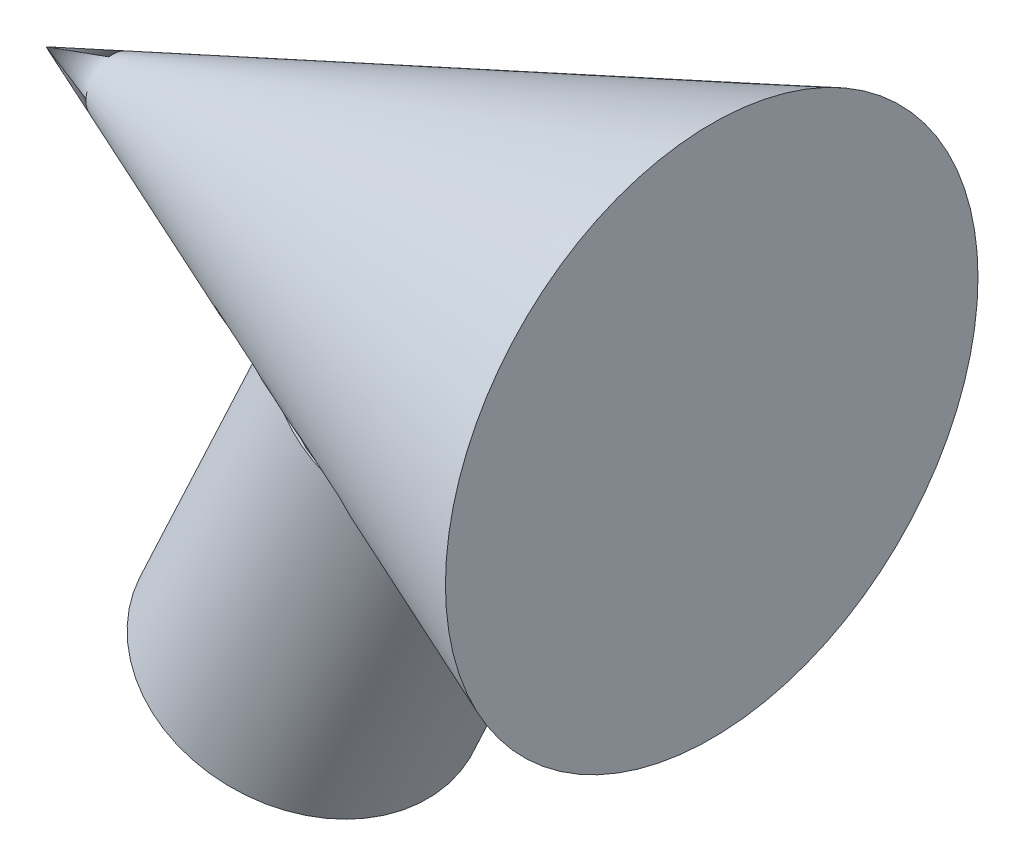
from build123d import *


with BuildPart() as part:
    # Sketch 1 → Revolve 1 (revolve)
    with BuildSketch(Plane.XY, mode=Mode.PRIVATE) as revolve_1_sk:
        Polygon((-56.216176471, 0), (-6.216176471, 20), (-6.216176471, 0), align=None)
    revolve(revolve_1_sk.sketch.rotate(Axis((-68.169117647, 0, 0), (1, 0, 0)), 270), axis=Axis((-68.169117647, 0, 0), (1, 0, 0)))

    # Sketch 2 → Revolve 2 (revolve)
    with BuildSketch(Plane.XY):
        Polygon((-34.83819658, -2.869344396), (-45.691277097, -26.143850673), (-36.628199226, -30.37003329), (-25.108088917, -5.665077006), align=None)
    revolve(axis=Axis((-25.620220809, -6.763347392, 0), (-0.42261826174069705, -0.906307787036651, 0)))


solid = part.part
